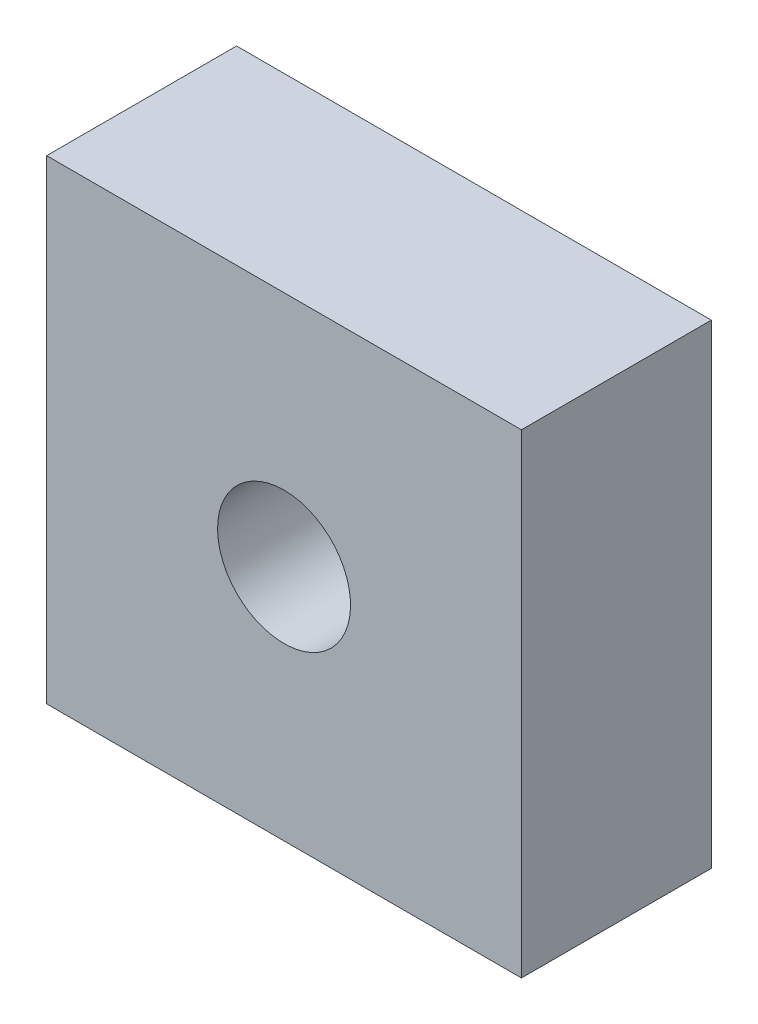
ISO-10303-21;
HEADER;
FILE_DESCRIPTION(('STEP AP214'),'2;1');
FILE_NAME('part.step','',(''),(''),'','','');
FILE_SCHEMA(('AUTOMOTIVE_DESIGN { 1 0 10303 214 1 1 1 1 }'));
ENDSEC;
DATA;
#1=APPLICATION_CONTEXT('core data for automotive mechanical design processes');
#2=APPLICATION_PROTOCOL_DEFINITION('international standard','automotive_design',2000,#1);
#3=PRODUCT_CONTEXT('',#1,'mechanical');
#4=PRODUCT('Part','Part','',(#3));
#5=PRODUCT_RELATED_PRODUCT_CATEGORY('part','',(#4));
#6=PRODUCT_DEFINITION_FORMATION('','',#4);
#7=PRODUCT_DEFINITION_CONTEXT('part definition',#1,'design');
#8=PRODUCT_DEFINITION('design','',#6,#7);
#9=PRODUCT_DEFINITION_SHAPE('','',#8);
#10=(LENGTH_UNIT() NAMED_UNIT(*) SI_UNIT(.MILLI.,.METRE.));
#11=(NAMED_UNIT(*) PLANE_ANGLE_UNIT() SI_UNIT($,.RADIAN.));
#12=(NAMED_UNIT(*) SI_UNIT($,.STERADIAN.) SOLID_ANGLE_UNIT());
#13=UNCERTAINTY_MEASURE_WITH_UNIT(LENGTH_MEASURE(1.E-05),#10,'distance_accuracy_value','');
#14=(GEOMETRIC_REPRESENTATION_CONTEXT(3) GLOBAL_UNCERTAINTY_ASSIGNED_CONTEXT((#13)) GLOBAL_UNIT_ASSIGNED_CONTEXT((#10,
#11,#12)) REPRESENTATION_CONTEXT('',''));
#15=CARTESIAN_POINT('',(0.,0.,0.));
#16=DIRECTION('',(0.,0.,1.));
#17=DIRECTION('',(1.,0.,0.));
#18=AXIS2_PLACEMENT_3D('',#15,#16,#17);
#19=CARTESIAN_POINT('',(-15.875,-15.875,1.5875));
#20=DIRECTION('',(-1.,0.,0.));
#21=DIRECTION('',(0.,-1.,0.));
#22=AXIS2_PLACEMENT_3D('',#19,#20,#21);
#23=PLANE('',#22);
#24=DIRECTION('',(0.,-1.,0.));
#25=VECTOR('',#24,1.);
#26=CARTESIAN_POINT('',(-15.875,-15.875,12.7));
#27=LINE('',#26,#25);
#28=CARTESIAN_POINT('',(-15.875,15.875,12.7));
#29=VERTEX_POINT('',#28);
#30=CARTESIAN_POINT('',(-15.875,-15.875,12.7));
#31=VERTEX_POINT('',#30);
#32=EDGE_CURVE('E70',#29,#31,#27,.T.);
#33=ORIENTED_EDGE('',*,*,#32,.F.);
#34=DIRECTION('',(0.,0.,1.));
#35=VECTOR('',#34,1.);
#36=CARTESIAN_POINT('',(-15.875,15.875,1.5875));
#37=LINE('',#36,#35);
#38=CARTESIAN_POINT('',(-15.875,15.875,0.));
#39=VERTEX_POINT('',#38);
#40=EDGE_CURVE('E9',#39,#29,#37,.T.);
#41=ORIENTED_EDGE('',*,*,#40,.F.);
#42=DIRECTION('',(0.,-1.,0.));
#43=VECTOR('',#42,1.);
#44=CARTESIAN_POINT('',(-15.875,15.875,0.));
#45=LINE('',#44,#43);
#46=CARTESIAN_POINT('',(-15.875,-15.875,0.));
#47=VERTEX_POINT('',#46);
#48=EDGE_CURVE('E148',#39,#47,#45,.T.);
#49=ORIENTED_EDGE('',*,*,#48,.T.);
#50=DIRECTION('',(0.,0.,1.));
#51=VECTOR('',#50,1.);
#52=CARTESIAN_POINT('',(-15.875,-15.875,1.5875));
#53=LINE('',#52,#51);
#54=EDGE_CURVE('E51',#47,#31,#53,.T.);
#55=ORIENTED_EDGE('',*,*,#54,.T.);
#56=EDGE_LOOP('',(#33,#41,#49,#55));
#57=FACE_BOUND('',#56,.T.);
#58=ADVANCED_FACE('F14',(#57),#23,.T.);
#59=CARTESIAN_POINT('',(-15.875,15.875,1.5875));
#60=DIRECTION('',(0.,1.,0.));
#61=DIRECTION('',(-1.,0.,0.));
#62=AXIS2_PLACEMENT_3D('',#59,#60,#61);
#63=PLANE('',#62);
#64=DIRECTION('',(-1.,0.,0.));
#65=VECTOR('',#64,1.);
#66=CARTESIAN_POINT('',(-15.875,15.875,12.7));
#67=LINE('',#66,#65);
#68=CARTESIAN_POINT('',(15.875,15.875,12.7));
#69=VERTEX_POINT('',#68);
#70=EDGE_CURVE('E64',#69,#29,#67,.T.);
#71=ORIENTED_EDGE('',*,*,#70,.F.);
#72=DIRECTION('',(0.,0.,1.));
#73=VECTOR('',#72,1.);
#74=CARTESIAN_POINT('',(15.875,15.875,1.5875));
#75=LINE('',#74,#73);
#76=CARTESIAN_POINT('',(15.875,15.875,0.));
#77=VERTEX_POINT('',#76);
#78=EDGE_CURVE('E25',#77,#69,#75,.T.);
#79=ORIENTED_EDGE('',*,*,#78,.F.);
#80=DIRECTION('',(-1.,0.,0.));
#81=VECTOR('',#80,1.);
#82=CARTESIAN_POINT('',(-15.875,15.875,0.));
#83=LINE('',#82,#81);
#84=EDGE_CURVE('E66',#77,#39,#83,.T.);
#85=ORIENTED_EDGE('',*,*,#84,.T.);
#86=ORIENTED_EDGE('',*,*,#40,.T.);
#87=EDGE_LOOP('',(#71,#79,#85,#86));
#88=FACE_BOUND('',#87,.T.);
#89=ADVANCED_FACE('F62',(#88),#63,.T.);
#90=CARTESIAN_POINT('',(15.875,15.875,1.5875));
#91=DIRECTION('',(1.,0.,0.));
#92=DIRECTION('',(0.,1.,0.));
#93=AXIS2_PLACEMENT_3D('',#90,#91,#92);
#94=PLANE('',#93);
#95=DIRECTION('',(0.,1.,0.));
#96=VECTOR('',#95,1.);
#97=CARTESIAN_POINT('',(15.875,15.875,12.7));
#98=LINE('',#97,#96);
#99=CARTESIAN_POINT('',(15.875,-15.875,12.7));
#100=VERTEX_POINT('',#99);
#101=EDGE_CURVE('E34',#100,#69,#98,.T.);
#102=ORIENTED_EDGE('',*,*,#101,.F.);
#103=DIRECTION('',(0.,0.,1.));
#104=VECTOR('',#103,1.);
#105=CARTESIAN_POINT('',(15.875,-15.875,1.5875));
#106=LINE('',#105,#104);
#107=CARTESIAN_POINT('',(15.875,-15.875,0.));
#108=VERTEX_POINT('',#107);
#109=EDGE_CURVE('E55',#108,#100,#106,.T.);
#110=ORIENTED_EDGE('',*,*,#109,.F.);
#111=DIRECTION('',(0.,1.,0.));
#112=VECTOR('',#111,1.);
#113=CARTESIAN_POINT('',(15.875,15.875,0.));
#114=LINE('',#113,#112);
#115=EDGE_CURVE('E140',#108,#77,#114,.T.);
#116=ORIENTED_EDGE('',*,*,#115,.T.);
#117=ORIENTED_EDGE('',*,*,#78,.T.);
#118=EDGE_LOOP('',(#102,#110,#116,#117));
#119=FACE_BOUND('',#118,.T.);
#120=ADVANCED_FACE('F111',(#119),#94,.T.);
#121=CARTESIAN_POINT('',(15.875,-15.875,1.5875));
#122=DIRECTION('',(0.,-1.,0.));
#123=DIRECTION('',(1.,0.,0.));
#124=AXIS2_PLACEMENT_3D('',#121,#122,#123);
#125=PLANE('',#124);
#126=DIRECTION('',(1.,0.,0.));
#127=VECTOR('',#126,1.);
#128=CARTESIAN_POINT('',(15.875,-15.875,12.7));
#129=LINE('',#128,#127);
#130=EDGE_CURVE('E73',#31,#100,#129,.T.);
#131=ORIENTED_EDGE('',*,*,#130,.F.);
#132=ORIENTED_EDGE('',*,*,#54,.F.);
#133=DIRECTION('',(1.,0.,0.));
#134=VECTOR('',#133,1.);
#135=CARTESIAN_POINT('',(-15.875,-15.875,0.));
#136=LINE('',#135,#134);
#137=EDGE_CURVE('E150',#47,#108,#136,.T.);
#138=ORIENTED_EDGE('',*,*,#137,.T.);
#139=ORIENTED_EDGE('',*,*,#109,.T.);
#140=EDGE_LOOP('',(#131,#132,#138,#139));
#141=FACE_BOUND('',#140,.T.);
#142=ADVANCED_FACE('F114',(#141),#125,.T.);
#143=CARTESIAN_POINT('',(0.,0.,12.7));
#144=DIRECTION('',(0.,0.,1.));
#145=DIRECTION('',(0.,-1.,0.));
#146=AXIS2_PLACEMENT_3D('',#143,#144,#145);
#147=PLANE('',#146);
#148=CARTESIAN_POINT('',(0.,0.,12.7));
#149=DIRECTION('',(0.,0.,-1.));
#150=DIRECTION('',(0.,1.,0.));
#151=AXIS2_PLACEMENT_3D('',#148,#149,#150);
#152=CIRCLE('',#151,4.445);
#153=CARTESIAN_POINT('',(0.,4.445,12.7));
#154=VERTEX_POINT('',#153);
#155=EDGE_CURVE('E74',#154,#154,#152,.T.);
#156=ORIENTED_EDGE('',*,*,#155,.T.);
#157=EDGE_LOOP('',(#156));
#158=FACE_BOUND('',#157,.T.);
#159=ORIENTED_EDGE('',*,*,#70,.T.);
#160=ORIENTED_EDGE('',*,*,#32,.T.);
#161=ORIENTED_EDGE('',*,*,#130,.T.);
#162=ORIENTED_EDGE('',*,*,#101,.T.);
#163=EDGE_LOOP('',(#159,#160,#161,#162));
#164=FACE_BOUND('',#163,.T.);
#165=ADVANCED_FACE('F76',(#158,#164),#147,.T.);
#166=CARTESIAN_POINT('',(0.,0.,12.7));
#167=DIRECTION('',(0.,0.,-1.));
#168=DIRECTION('',(0.,1.,0.));
#169=AXIS2_PLACEMENT_3D('',#166,#167,#168);
#170=CYLINDRICAL_SURFACE('',#169,4.445);
#171=CARTESIAN_POINT('',(0.,0.,3.16242337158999));
#172=DIRECTION('',(0.,0.,1.));
#173=DIRECTION('',(0.,-1.,0.));
#174=AXIS2_PLACEMENT_3D('',#171,#172,#173);
#175=CIRCLE('',#174,4.445);
#176=CARTESIAN_POINT('',(0.,-4.445,3.16242337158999));
#177=VERTEX_POINT('',#176);
#178=EDGE_CURVE('E151',#177,#177,#175,.T.);
#179=ORIENTED_EDGE('',*,*,#178,.F.);
#180=EDGE_LOOP('',(#179));
#181=FACE_BOUND('',#180,.T.);
#182=ORIENTED_EDGE('',*,*,#155,.F.);
#183=EDGE_LOOP('',(#182));
#184=FACE_BOUND('',#183,.T.);
#185=ADVANCED_FACE('F104',(#181,#184),#170,.F.);
#186=CARTESIAN_POINT('',(0.,0.,1.5875));
#187=DIRECTION('',(0.,0.,1.));
#188=DIRECTION('',(0.,-1.,0.));
#189=AXIS2_PLACEMENT_3D('',#186,#187,#188);
#190=CONICAL_SURFACE('',#189,3.07594,0.715584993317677);
#191=ORIENTED_EDGE('',*,*,#178,.T.);
#192=EDGE_LOOP('',(#191));
#193=FACE_BOUND('',#192,.T.);
#194=CARTESIAN_POINT('',(0.,0.,1.5875));
#195=DIRECTION('',(0.,0.,1.));
#196=DIRECTION('',(0.,1.,0.));
#197=AXIS2_PLACEMENT_3D('',#194,#195,#196);
#198=CIRCLE('',#197,3.07589561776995);
#199=CARTESIAN_POINT('',(0.,3.07589561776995,1.5875));
#200=VERTEX_POINT('',#199);
#201=EDGE_CURVE('E88',#200,#200,#198,.T.);
#202=ORIENTED_EDGE('',*,*,#201,.F.);
#203=EDGE_LOOP('',(#202));
#204=FACE_BOUND('',#203,.T.);
#205=ADVANCED_FACE('F95',(#193,#204),#190,.F.);
#206=CARTESIAN_POINT('',(0.,0.,0.));
#207=DIRECTION('',(0.,0.,1.));
#208=DIRECTION('',(0.,-1.,0.));
#209=AXIS2_PLACEMENT_3D('',#206,#207,#208);
#210=PLANE('',#209);
#211=ORIENTED_EDGE('',*,*,#115,.F.);
#212=ORIENTED_EDGE('',*,*,#137,.F.);
#213=ORIENTED_EDGE('',*,*,#48,.F.);
#214=ORIENTED_EDGE('',*,*,#84,.F.);
#215=EDGE_LOOP('',(#211,#212,#213,#214));
#216=FACE_BOUND('',#215,.T.);
#217=CARTESIAN_POINT('',(0.,0.,0.));
#218=DIRECTION('',(0.,0.,-1.));
#219=DIRECTION('',(0.,1.,0.));
#220=AXIS2_PLACEMENT_3D('',#217,#218,#219);
#221=CIRCLE('',#220,2.2479);
#222=CARTESIAN_POINT('',(0.,2.2479,0.));
#223=VERTEX_POINT('',#222);
#224=EDGE_CURVE('E93',#223,#223,#221,.T.);
#225=ORIENTED_EDGE('',*,*,#224,.F.);
#226=EDGE_LOOP('',(#225));
#227=FACE_BOUND('',#226,.T.);
#228=ADVANCED_FACE('F16',(#216,#227),#210,.F.);
#229=CARTESIAN_POINT('',(0.,0.,1.5875));
#230=DIRECTION('',(0.,0.,-1.));
#231=DIRECTION('',(0.,1.,0.));
#232=AXIS2_PLACEMENT_3D('',#229,#230,#231);
#233=CYLINDRICAL_SURFACE('',#232,2.2479);
#234=ORIENTED_EDGE('',*,*,#224,.T.);
#235=EDGE_LOOP('',(#234));
#236=FACE_BOUND('',#235,.T.);
#237=CARTESIAN_POINT('',(0.,0.,0.635));
#238=DIRECTION('',(0.,0.,-1.));
#239=DIRECTION('',(0.,1.,0.));
#240=AXIS2_PLACEMENT_3D('',#237,#238,#239);
#241=CIRCLE('',#240,2.2479);
#242=CARTESIAN_POINT('',(0.,2.2479,0.635));
#243=VERTEX_POINT('',#242);
#244=EDGE_CURVE('E143',#243,#243,#241,.T.);
#245=ORIENTED_EDGE('',*,*,#244,.F.);
#246=EDGE_LOOP('',(#245));
#247=FACE_BOUND('',#246,.T.);
#248=ADVANCED_FACE('F119',(#236,#247),#233,.F.);
#249=CARTESIAN_POINT('',(0.,0.,1.5875));
#250=DIRECTION('',(0.,0.,1.));
#251=DIRECTION('',(0.,-1.,0.));
#252=AXIS2_PLACEMENT_3D('',#249,#250,#251);
#253=CONICAL_SURFACE('',#252,3.07589561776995,0.715584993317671);
#254=ORIENTED_EDGE('',*,*,#244,.T.);
#255=EDGE_LOOP('',(#254));
#256=FACE_BOUND('',#255,.T.);
#257=ORIENTED_EDGE('',*,*,#201,.T.);
#258=EDGE_LOOP('',(#257));
#259=FACE_BOUND('',#258,.T.);
#260=ADVANCED_FACE('F124',(#256,#259),#253,.F.);
#261=CLOSED_SHELL('',(#58,#89,#120,#142,#165,#185,#205,#228,#248,#260));
#262=MANIFOLD_SOLID_BREP('B1',#261);
#263=ADVANCED_BREP_SHAPE_REPRESENTATION('',(#18,#262),#14);
#264=SHAPE_DEFINITION_REPRESENTATION(#9,#263);
ENDSEC;
END-ISO-10303-21;
